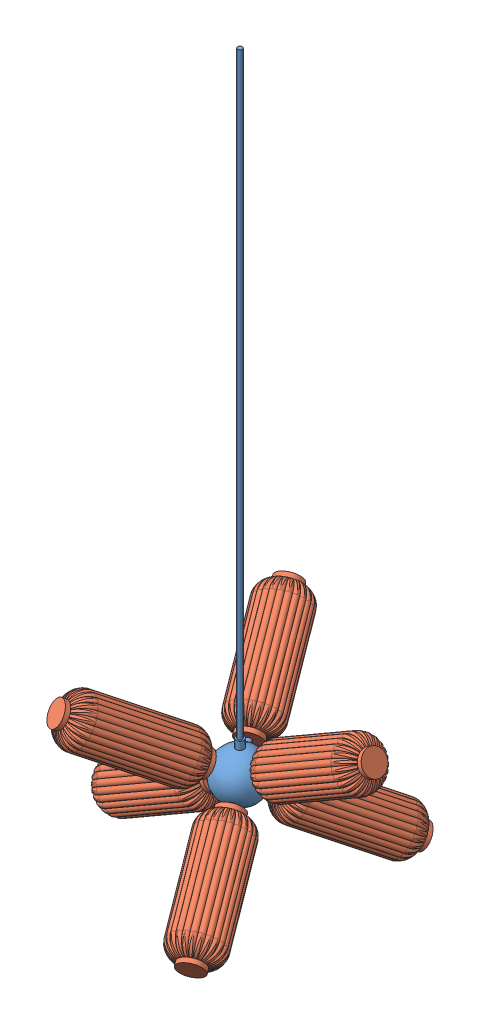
SolidWorks assembly Prueba_otra_M.SLDASM, configuration Predeterminado (file format 11000). Lengths in mm.
Overall size (748.7 1848.71 679).
7 component instances, 2 part files, 8 mates.
Components (placement in the parent):
- Colgante_6-1: Colgante_6.SLDPRT [Predeterminado] at origin size (128.24 1639.16 120)
- Cabezal_ELMA-7: Cabezal_ELMA.SLDPRT [Predeterminado] at (69.282 40 0) x (0.378502 -0.655584 -0.653411) z (0.326706 -0.565871 0.757003) size (123.5 320 123.5)
- Cabezal_ELMA-21: Cabezal_ELMA.SLDPRT [Predeterminado] at (-69.282 -40 0) x (0.289165 -0.500849 -0.815803) z (-0.407901 0.706506 -0.57833) size (123.5 320 123.5)
- Cabezal_ELMA-22: Cabezal_ELMA.SLDPRT [Predeterminado] at (-34.641 40 60) x (0.37662 -0.655584 0.654498) z (-0.818937 -0.565871 -0.095566) size (123.5 320 123.5)
- Cabezal_ELMA-23: Cabezal_ELMA.SLDPRT [Predeterminado] at (-34.641 40 -60) x (-0.755122 -0.655584 -0.001086) z (0.492231 -0.565871 -0.661437) size (123.5 320 123.5)
- Cabezal_ELMA-24: Cabezal_ELMA.SLDPRT [Predeterminado] at (34.641 -40 -60) x (0.561923 -0.500849 0.658326) z (0.7048 0.706506 -0.064088) size (123.5 320 123.5)
- Cabezal_ELMA-25: Cabezal_ELMA.SLDPRT [Predeterminado] at (34.641 -40 60) x (-0.851088 -0.500849 0.157477) z (-0.296898 0.706506 0.642418) size (123.5 320 123.5)
Mates (geometry in assembly coordinates):
- Concéntrica4: concentric: cylinder of assembly; cylinder of assembly; cylinder of Colgante_6-1 through (0 0 0) axis (0.866025 0.5 0) radius 7; cylinder of Cabezal_ELMA-7 through (60.6218 35 0) axis (0.866025 0.5 0) radius 30
- Coincidente7: coincident: plane of assembly; plane of assembly; plane of Colgante_6-1 through (60.6218 35 0) normal (0.866025 0.5 0); plane of Cabezal_ELMA-7 through (60.6218 35 0) normal (-0.866025 -0.5 0)
- Concéntrica5: concentric: cylinder of assembly; cylinder of assembly; cylinder of Colgante_6-1 through (0 0 0) axis (0.866025 0.5 0) radius 7; cylinder of Cabezal_ELMA-7 through (60.6218 35 0) axis (0.866025 0.5 0) radius 30
- Coincidente8: coincident: plane of assembly; plane of assembly; plane of Colgante_6-1 through (60.6218 35 0) normal (0.866025 0.5 0); plane of Cabezal_ELMA-7 through (60.6218 35 0) normal (-0.866025 -0.5 0)
- Concéntrica6: concentric: cylinder of assembly; cylinder of assembly; cylinder of Colgante_6-1 through (0 0 0) axis (0.866025 0.5 0) radius 7; cylinder of Cabezal_ELMA-7 through (60.6218 35 0) axis (0.866025 0.5 0) radius 30
- Coincidente9: coincident: plane of assembly; plane of assembly; plane of Colgante_6-1 through (60.6218 35 0) normal (0.866025 0.5 0); plane of Cabezal_ELMA-7 through (60.6218 35 0) normal (-0.866025 -0.5 0)
- Concéntrica7: concentric: cylinder of assembly; cylinder of assembly; cylinder of Colgante_6-1 through (-60.6218 -35 0) axis (0.866025 0.5 0) radius 7; cylinder of Cabezal_ELMA-21 through (-60.6218 -35 0) axis (-0.866025 -0.5 0) radius 30
- Coincidente10: coincident: plane of assembly; plane of assembly; plane of Colgante_6-1 through (-60.6218 -35 0) normal (-0.866025 -0.5 0); plane of Cabezal_ELMA-21 through (-60.6218 -35 0) normal (0.866025 0.5 0)
